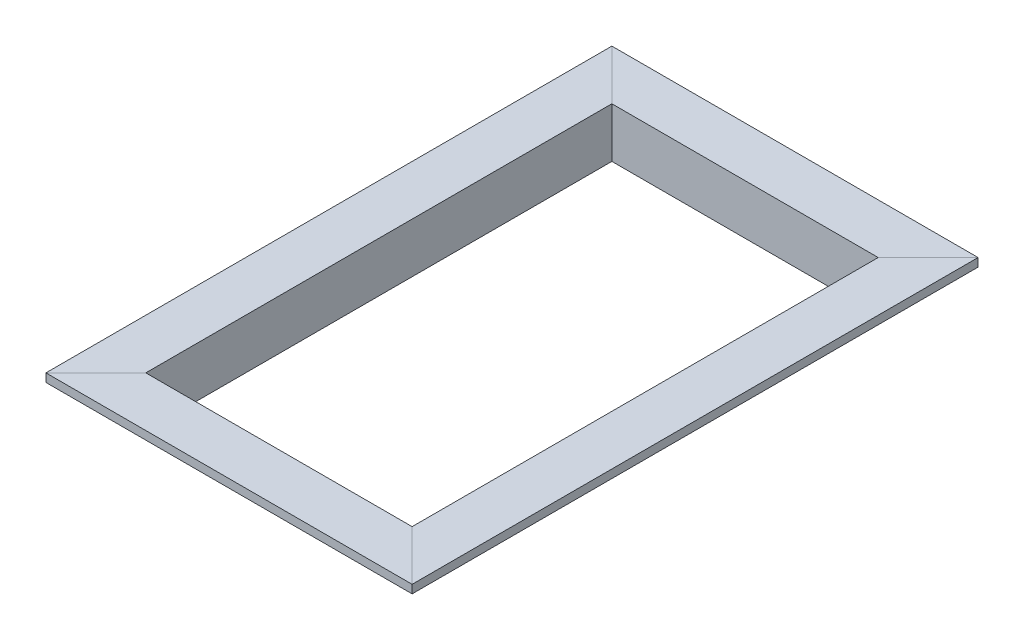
from build123d import *

# Parameters (mm, degrees)
BOSS_EXTRUDE1_DEPTH   = 88.9
BOSS_EXTRUDE1_2_DEPTH = 88.9
SKETCH2_W             = 139.7
SKETCH2_H             = 19.05
BOSS_EXTRUDE2_DEPTH   = 3.175
SKETCH3_W             = 107.95
SKETCH3_H             = 3.175
BOSS_EXTRUDE3_DEPTH   = 15.875
CUT_EXTRUDE1_DEPTH    = 178.573069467


with BuildPart() as part:
    # Sketch1 → Boss-Extrude1 (new, symmetric)
    with BuildSketch(Plane.XY):
        Polygon((0, 0), (19.05, 0), (19.05, -19.05), (15.875, -19.05), (15.875, -3.175), (0, -3.175), align=None)
    extrude(amount=BOSS_EXTRUDE1_DEPTH, both=True)



with BuildPart() as body_2:
    # Sketch1 → Boss-Extrude1 2 (new, symmetric)
    with BuildSketch(Plane.XY):
        Polygon((123.825, -19.05), (120.65, -19.05), (120.65, 0), (139.7, 0), (139.7, -3.175), (123.825, -3.175), align=None)
    extrude(amount=BOSS_EXTRUDE1_2_DEPTH, both=True)


with BuildPart() as part_1:
    add(part.part)

    add(body_2.part)  # Boss-Extrude2 merges body 2
    # Sketch2 → Boss-Extrude2 (add)
    with BuildSketch(Plane(origin=(0, 0, 0), x_dir=(1, 0, 0), z_dir=(0, 1, 0))):
        with Locations((69.85, 98.425)):
            Rectangle(SKETCH2_W, SKETCH2_H)
        with Locations((69.85, -98.425)):
            Rectangle(SKETCH2_W, SKETCH2_H)
    extrude(amount=-BOSS_EXTRUDE2_DEPTH)

    # Sketch3 → Boss-Extrude3 (add)
    with BuildSketch(Plane.XZ.offset(3.175)):
        with Locations((69.85, 90.4875)):
            Rectangle(SKETCH3_W, SKETCH3_H)
        with Locations((69.85, -90.4875)):
            Rectangle(SKETCH3_W, SKETCH3_H)
    extrude(amount=BOSS_EXTRUDE3_DEPTH)

    # Sketch4 → Cut-Extrude1 (cut, through all)
    with BuildSketch(Plane(origin=(0, 0, 0), x_dir=(1, 0, 0), z_dir=(0, 1, 0))):
        Polygon((-0.017960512, 107.932039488), (19.032039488, 88.882039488), (24.022036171, 83.892042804), (24.057957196, 83.927963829), (19.067960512, 88.917960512), (0.017960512, 107.967960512), align=None)
        Polygon((115.677963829, 83.892042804), (115.642042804, 83.927963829), (120.632039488, 88.917960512), (139.682039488, 107.967960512), (139.717960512, 107.932039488), (120.667960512, 88.882039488), align=None)
        Polygon((139.717960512, -107.932039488), (120.667960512, -88.882039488), (115.677963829, -83.892042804), (115.642042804, -83.927963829), (120.632039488, -88.917960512), (139.682039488, -107.967960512), align=None)
        Polygon((24.022036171, -83.892042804), (24.057957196, -83.927963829), (19.067960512, -88.917960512), (0.017960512, -107.967960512), (-0.017960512, -107.932039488), (19.032039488, -88.882039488), align=None)
    extrude(amount=-CUT_EXTRUDE1_DEPTH, mode=Mode.SUBTRACT)


with BuildPart() as cut_extrude1_piece_1:
    # of the separate pieces the step leaves, piece 1, a body of its own (cut_extrude1_pieces)
    add(part_1.part.solids().sort_by_distance((0, 0, -107.914078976))[0])


with BuildPart() as cut_extrude1_piece_2:
    # of the separate pieces the step leaves, piece 2, a body of its own (cut_extrude1_pieces)
    add(part_1.part.solids().sort_by_distance((139.7, 0, -107.914078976))[0])


with BuildPart() as cut_extrude1_piece_3:
    # of the separate pieces the step leaves, piece 3, a body of its own (cut_extrude1_pieces)
    add(part_1.part.solids().sort_by_distance((0.035921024, 0, -107.95))[0])


with BuildPart() as cut_extrude1_piece_4:
    # of the separate pieces the step leaves, piece 4, a body of its own (cut_extrude1_pieces)
    add(part_1.part.solids().sort_by_distance((139.664078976, 0, 107.95))[0])


solid = Compound([cut_extrude1_piece_1.part, cut_extrude1_piece_2.part, cut_extrude1_piece_3.part, cut_extrude1_piece_4.part])
